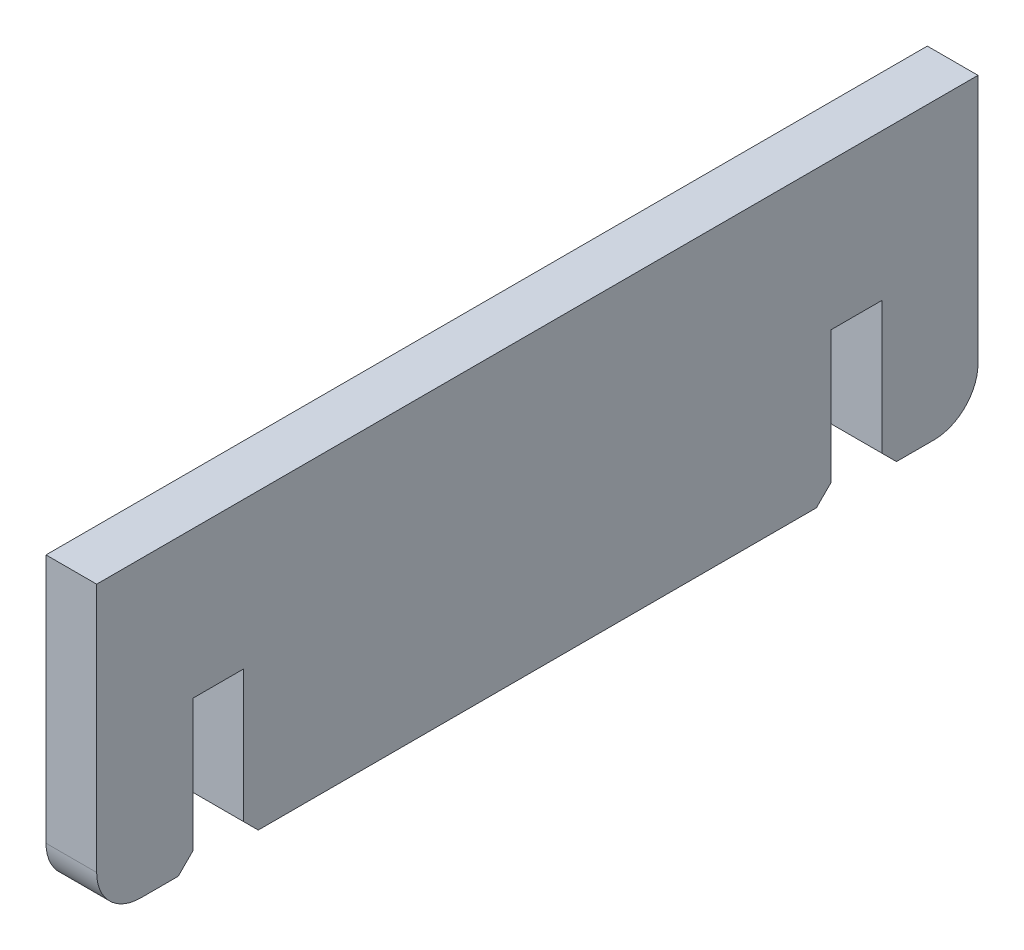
from build123d import *

# Parameters (mm, degrees)
SKETCH1_W           = 300
SKETCH1_H           = 100
BOSS_EXTRUDE1_DEPTH = 17.25
CUT_EXTRUDE1_START  = 17.25
SKETCH2_W           = 17.25
SKETCH2_H           = 50
CUT_EXTRUDE1_DEPTH  = 177.302074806
FILLET1_R           = 15
CHAMFER1_SIZE       = 5


with BuildPart() as part:
    # Sketch1 → Boss-Extrude1 (new body)
    with BuildSketch(Plane(origin=(0, 0, 0), x_dir=(0, 0, -1), z_dir=(1, 0, 0))):
        Rectangle(SKETCH1_W, SKETCH1_H)
    extrude(amount=BOSS_EXTRUDE1_DEPTH)

    # Sketch2 → Cut-Extrude1 (cut, through all)
    with BuildSketch(Plane(origin=(0, 0, 0), x_dir=(0, 0, -1), z_dir=(1, 0, 0)).offset(CUT_EXTRUDE1_START)):
        with Locations((-108.625, -25)):
            Rectangle(SKETCH2_W, SKETCH2_H)
    cut_extrude1 = extrude(amount=-CUT_EXTRUDE1_DEPTH, mode=Mode.SUBTRACT)

    # Mirror1: Cut-Extrude1 across plane
    add(cut_extrude1.mirror(Plane.XY), mode=Mode.SUBTRACT)

    # Fillet1
    fillet1_edges = [part.edges().sort_by_distance(p)[0] for p in [
        (8.625, -50, -150),
        (8.625, -50, 150),
    ]]
    fillet(fillet1_edges, radius=FILLET1_R)

    # Chamfer1
    chamfer1_edges = [part.edges().sort_by_distance(p)[0] for p in [
        (8.625, -50, 117.25),
        (8.625, -50, 100),
        (8.625, -50, -100),
        (8.625, -50, -117.25),
    ]]
    chamfer(chamfer1_edges, length=CHAMFER1_SIZE)


solid = part.part
